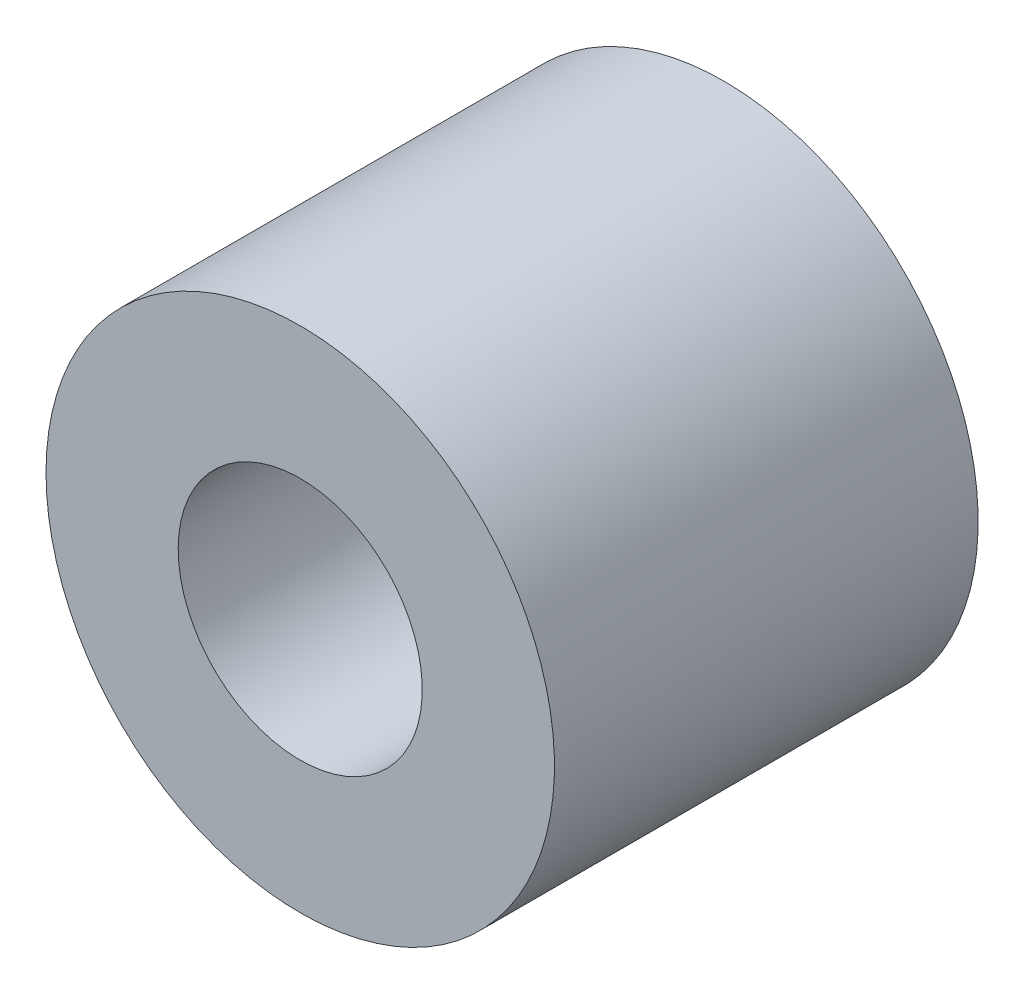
ISO-10303-21;
HEADER;
FILE_DESCRIPTION(('STEP AP214'),'2;1');
FILE_NAME('part.step','',(''),(''),'','','');
FILE_SCHEMA(('AUTOMOTIVE_DESIGN { 1 0 10303 214 1 1 1 1 }'));
ENDSEC;
DATA;
#1=APPLICATION_CONTEXT('core data for automotive mechanical design processes');
#2=APPLICATION_PROTOCOL_DEFINITION('international standard','automotive_design',2000,#1);
#3=PRODUCT_CONTEXT('',#1,'mechanical');
#4=PRODUCT('Part','Part','',(#3));
#5=PRODUCT_RELATED_PRODUCT_CATEGORY('part','',(#4));
#6=PRODUCT_DEFINITION_FORMATION('','',#4);
#7=PRODUCT_DEFINITION_CONTEXT('part definition',#1,'design');
#8=PRODUCT_DEFINITION('design','',#6,#7);
#9=PRODUCT_DEFINITION_SHAPE('','',#8);
#10=(LENGTH_UNIT() NAMED_UNIT(*) SI_UNIT(.MILLI.,.METRE.));
#11=(NAMED_UNIT(*) PLANE_ANGLE_UNIT() SI_UNIT($,.RADIAN.));
#12=(NAMED_UNIT(*) SI_UNIT($,.STERADIAN.) SOLID_ANGLE_UNIT());
#13=UNCERTAINTY_MEASURE_WITH_UNIT(LENGTH_MEASURE(1.E-05),#10,'distance_accuracy_value','');
#14=(GEOMETRIC_REPRESENTATION_CONTEXT(3) GLOBAL_UNCERTAINTY_ASSIGNED_CONTEXT((#13)) GLOBAL_UNIT_ASSIGNED_CONTEXT((#10,
#11,#12)) REPRESENTATION_CONTEXT('',''));
#15=CARTESIAN_POINT('',(0.,0.,0.));
#16=DIRECTION('',(0.,0.,1.));
#17=DIRECTION('',(1.,0.,0.));
#18=AXIS2_PLACEMENT_3D('',#15,#16,#17);
#19=CARTESIAN_POINT('',(0.,0.,-3.96875));
#20=DIRECTION('',(0.,0.,1.));
#21=DIRECTION('',(1.,0.,0.));
#22=AXIS2_PLACEMENT_3D('',#19,#20,#21);
#23=CYLINDRICAL_SURFACE('',#22,2.38125);
#24=CARTESIAN_POINT('',(0.,0.,-3.96875));
#25=DIRECTION('',(0.,0.,-1.));
#26=DIRECTION('',(-1.,0.,0.));
#27=AXIS2_PLACEMENT_3D('',#24,#25,#26);
#28=CIRCLE('',#27,2.38125);
#29=CARTESIAN_POINT('',(-2.38125,0.,-3.96875));
#30=VERTEX_POINT('',#29);
#31=EDGE_CURVE('E10',#30,#30,#28,.T.);
#32=ORIENTED_EDGE('',*,*,#31,.F.);
#33=EDGE_LOOP('',(#32));
#34=FACE_BOUND('',#33,.T.);
#35=CARTESIAN_POINT('',(0.,0.,0.));
#36=DIRECTION('',(0.,0.,-1.));
#37=DIRECTION('',(-1.,0.,0.));
#38=AXIS2_PLACEMENT_3D('',#35,#36,#37);
#39=CIRCLE('',#38,2.38125);
#40=CARTESIAN_POINT('',(-2.38125,0.,0.));
#41=VERTEX_POINT('',#40);
#42=EDGE_CURVE('E35',#41,#41,#39,.T.);
#43=ORIENTED_EDGE('',*,*,#42,.T.);
#44=EDGE_LOOP('',(#43));
#45=FACE_BOUND('',#44,.T.);
#46=ADVANCED_FACE('F32',(#34,#45),#23,.T.);
#47=CARTESIAN_POINT('',(0.,0.,-3.96875));
#48=DIRECTION('',(0.,0.,-1.));
#49=DIRECTION('',(-1.,0.,0.));
#50=AXIS2_PLACEMENT_3D('',#47,#48,#49);
#51=PLANE('',#50);
#52=CARTESIAN_POINT('',(0.,0.,-3.96875));
#53=DIRECTION('',(0.,0.,-1.));
#54=DIRECTION('',(-1.,0.,0.));
#55=AXIS2_PLACEMENT_3D('',#52,#53,#54);
#56=CIRCLE('',#55,1.143);
#57=CARTESIAN_POINT('',(-1.143,0.,-3.96875));
#58=VERTEX_POINT('',#57);
#59=EDGE_CURVE('E44',#58,#58,#56,.T.);
#60=ORIENTED_EDGE('',*,*,#59,.F.);
#61=EDGE_LOOP('',(#60));
#62=FACE_BOUND('',#61,.T.);
#63=ORIENTED_EDGE('',*,*,#31,.T.);
#64=EDGE_LOOP('',(#63));
#65=FACE_BOUND('',#64,.T.);
#66=ADVANCED_FACE('F59',(#62,#65),#51,.T.);
#67=CARTESIAN_POINT('',(0.,0.,0.));
#68=DIRECTION('',(0.,0.,-1.));
#69=DIRECTION('',(-1.,0.,0.));
#70=AXIS2_PLACEMENT_3D('',#67,#68,#69);
#71=PLANE('',#70);
#72=CARTESIAN_POINT('',(0.,0.,0.));
#73=DIRECTION('',(0.,0.,-1.));
#74=DIRECTION('',(-1.,0.,0.));
#75=AXIS2_PLACEMENT_3D('',#72,#73,#74);
#76=CIRCLE('',#75,1.143);
#77=CARTESIAN_POINT('',(-1.143,0.,0.));
#78=VERTEX_POINT('',#77);
#79=EDGE_CURVE('E42',#78,#78,#76,.T.);
#80=ORIENTED_EDGE('',*,*,#79,.T.);
#81=EDGE_LOOP('',(#80));
#82=FACE_BOUND('',#81,.T.);
#83=ORIENTED_EDGE('',*,*,#42,.F.);
#84=EDGE_LOOP('',(#83));
#85=FACE_BOUND('',#84,.T.);
#86=ADVANCED_FACE('F50',(#82,#85),#71,.F.);
#87=CARTESIAN_POINT('',(0.,0.,0.));
#88=DIRECTION('',(0.,0.,-1.));
#89=DIRECTION('',(-1.,0.,0.));
#90=AXIS2_PLACEMENT_3D('',#87,#88,#89);
#91=CYLINDRICAL_SURFACE('',#90,1.143);
#92=ORIENTED_EDGE('',*,*,#79,.F.);
#93=EDGE_LOOP('',(#92));
#94=FACE_BOUND('',#93,.T.);
#95=ORIENTED_EDGE('',*,*,#59,.T.);
#96=EDGE_LOOP('',(#95));
#97=FACE_BOUND('',#96,.T.);
#98=ADVANCED_FACE('F53',(#94,#97),#91,.F.);
#99=CLOSED_SHELL('',(#46,#66,#86,#98));
#100=MANIFOLD_SOLID_BREP('B2',#99);
#101=ADVANCED_BREP_SHAPE_REPRESENTATION('',(#18,#100),#14);
#102=SHAPE_DEFINITION_REPRESENTATION(#9,#101);
ENDSEC;
END-ISO-10303-21;
